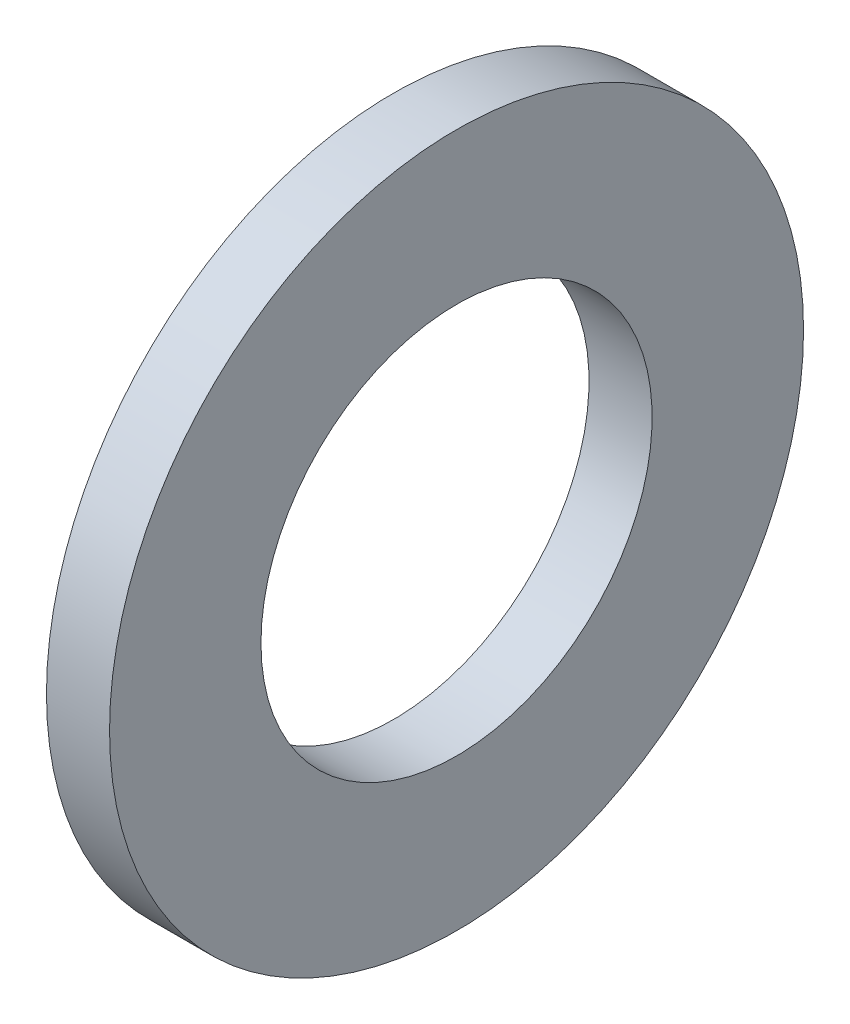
from build123d import *

# Parameters (mm, degrees)
ESQUISSE1_W = 5
ESQUISSE1_H = 12


with BuildPart() as part:
    # Esquisse1 → R_volution1 (revolve)
    with BuildSketch(Plane.XY, mode=Mode.PRIVATE) as r_volution1_sk:
        with Locations((2.5, 21.5)):
            Rectangle(ESQUISSE1_W, ESQUISSE1_H)
    revolve(r_volution1_sk.sketch.rotate(Axis((-6.479422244, 0, 0), (1, 0, 0)), 90), axis=Axis((-6.479422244, 0, 0), (1, 0, 0)))


solid = part.part
